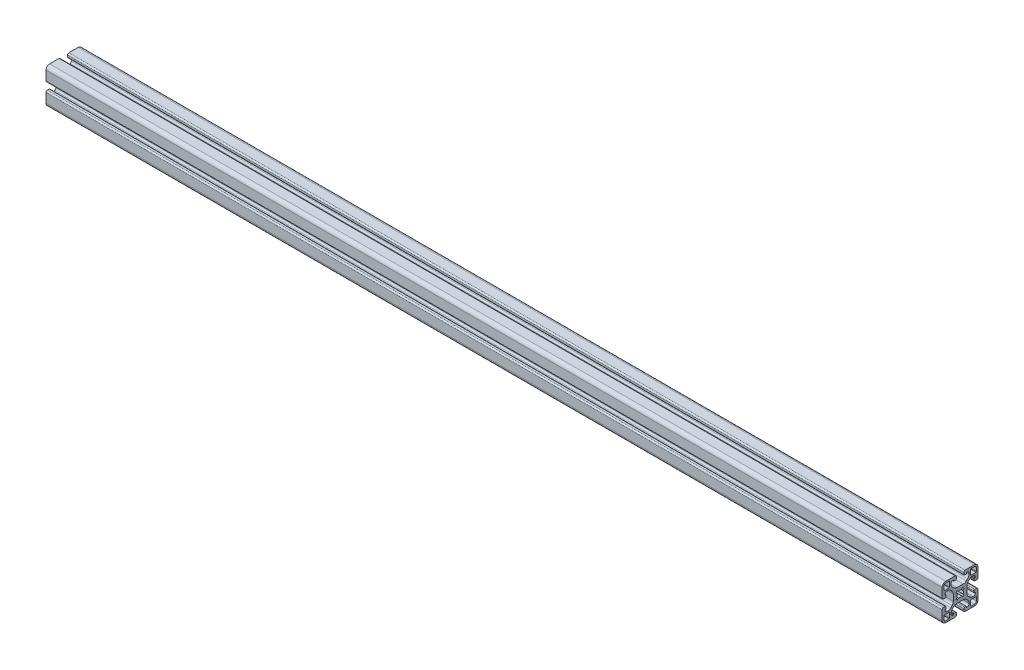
from build123d import *

# Parameters (mm, degrees)
F_40_SARJA_1_0112_40X40_6M_2_DEPTH = 1000


with BuildPart() as part:
    # Model4 → 40-sarja 1.0112 40X40 6M_2 (new body)
    with BuildSketch(Plane(origin=(0, 0, 0), x_dir=(0, 0, -1), z_dir=(1, 0, 0))):
        with BuildLine():
            Line((-10.316133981, -8.376879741), (-8.949467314, -6.916666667))
            ThreePointArc((-8.949467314, -6.916666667), (-7.949588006, -5.336754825), (-7.6, -3.5))
            Line((-7.6, -3.5), (-7.6, 3.5))
            ThreePointArc((-7.6, 3.5), (-7.949588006, 5.336754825), (-8.949467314, 6.916666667))
            Line((-8.949467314, 6.916666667), (-10.316133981, 8.376879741))
            ThreePointArc((-10.316133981, 8.376879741), (-12.018848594, 9.576744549), (-14.058399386, 10))
            Line((-14.058399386, 10), (-14.8, 10))
            ThreePointArc((-14.8, 10), (-16.355634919, 9.355634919), (-17, 7.8))
            Line((-17, 7.8), (-17, 7.6))
            ThreePointArc((-17, 7.6), (-16.853553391, 7.246446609), (-16.5, 7.1))
            Line((-16.5, 7.1), (-16, 7.1))
            ThreePointArc((-16, 7.1), (-15.646446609, 6.953553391), (-15.5, 6.6))
            Line((-15.5, 6.6), (-15.5, 5.1))
            ThreePointArc((-15.5, 5.1), (-15.792893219, 4.392893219), (-16.5, 4.1))
            Line((-16.5, 4.1), (-18.5, 4.1))
            ThreePointArc((-18.5, 4.1), (-19.560660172, 4.539339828), (-20, 5.6))
            Line((-20, 5.6), (-20, 16))
            ThreePointArc((-20, 16), (-18.828427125, 18.828427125), (-16, 20))
            Line((-16, 20), (-5.6, 20))
            ThreePointArc((-5.6, 20), (-4.539339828, 19.560660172), (-4.1, 18.5))
            Line((-4.1, 18.5), (-4.1, 16.5))
            ThreePointArc((-4.1, 16.5), (-4.392893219, 15.792893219), (-5.1, 15.5))
            Line((-5.1, 15.5), (-6.6, 15.5))
            ThreePointArc((-6.6, 15.5), (-6.953553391, 15.646446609), (-7.1, 16))
            Line((-7.1, 16), (-7.1, 16.5))
            ThreePointArc((-7.1, 16.5), (-7.246446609, 16.853553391), (-7.6, 17))
            Line((-7.6, 17), (-7.8, 17))
            ThreePointArc((-7.8, 17), (-9.355634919, 16.355634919), (-10, 14.8))
            Line((-10, 14.8), (-10, 14.053267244))
            ThreePointArc((-10, 14.053267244), (-9.576049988, 12.013150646), (-8.374399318, 10.310844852))
            Line((-8.374399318, 10.310844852), (-6.912704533, 8.945763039))
            ThreePointArc((-6.912704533, 8.945763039), (-5.334232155, 7.948592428), (-3.5, 7.6))
            Line((-3.5, 7.6), (3.5, 7.6))
            ThreePointArc((3.5, 7.6), (5.334232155, 7.948592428), (6.912704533, 8.945763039))
            Line((6.912704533, 8.945763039), (8.374399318, 10.310844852))
            ThreePointArc((8.374399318, 10.310844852), (9.576049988, 12.013150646), (10, 14.053267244))
            Line((10, 14.053267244), (10, 14.8))
            ThreePointArc((10, 14.8), (9.355634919, 16.355634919), (7.8, 17))
            Line((7.8, 17), (7.6, 17))
            ThreePointArc((7.6, 17), (7.246446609, 16.853553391), (7.1, 16.5))
            Line((7.1, 16.5), (7.1, 16))
            ThreePointArc((7.1, 16), (6.953553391, 15.646446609), (6.6, 15.5))
            Line((6.6, 15.5), (5.1, 15.5))
            ThreePointArc((5.1, 15.5), (4.392893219, 15.792893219), (4.1, 16.5))
            Line((4.1, 16.5), (4.1, 18.5))
            ThreePointArc((4.1, 18.5), (4.539339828, 19.560660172), (5.6, 20))
            Line((5.6, 20), (16, 20))
            ThreePointArc((16, 20), (18.828427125, 18.828427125), (20, 16))
            Line((20, 16), (20, 5.6))
            ThreePointArc((20, 5.6), (19.560660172, 4.539339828), (18.5, 4.1))
            Line((18.5, 4.1), (16.5, 4.1))
            ThreePointArc((16.5, 4.1), (15.792893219, 4.392893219), (15.5, 5.1))
            Line((15.5, 5.1), (15.5, 6.6))
            ThreePointArc((15.5, 6.6), (15.646446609, 6.953553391), (16, 7.1))
            Line((16, 7.1), (16.5, 7.1))
            ThreePointArc((16.5, 7.1), (16.853553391, 7.246446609), (17, 7.6))
            Line((17, 7.6), (17, 7.8))
            ThreePointArc((17, 7.8), (16.355634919, 9.355634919), (14.8, 10))
            Line((14.8, 10), (14.058399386, 10))
            ThreePointArc((14.058399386, 10), (12.018848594, 9.576744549), (10.316133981, 8.376879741))
            Line((10.316133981, 8.376879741), (8.949467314, 6.916666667))
            ThreePointArc((8.949467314, 6.916666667), (7.949588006, 5.336754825), (7.6, 3.5))
            Line((7.6, 3.5), (7.6, -3.5))
            ThreePointArc((7.6, -3.5), (7.949588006, -5.336754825), (8.949467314, -6.916666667))
            Line((8.949467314, -6.916666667), (10.316133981, -8.376879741))
            ThreePointArc((10.316133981, -8.376879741), (12.018848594, -9.576744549), (14.058399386, -10))
            Line((14.058399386, -10), (14.8, -10))
            ThreePointArc((14.8, -10), (16.355634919, -9.355634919), (17, -7.8))
            Line((17, -7.8), (17, -7.6))
            ThreePointArc((17, -7.6), (16.853553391, -7.246446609), (16.5, -7.1))
            Line((16.5, -7.1), (16, -7.1))
            ThreePointArc((16, -7.1), (15.646446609, -6.953553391), (15.5, -6.6))
            Line((15.5, -6.6), (15.5, -5.1))
            ThreePointArc((15.5, -5.1), (15.792893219, -4.392893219), (16.5, -4.1))
            Line((16.5, -4.1), (18.5, -4.1))
            ThreePointArc((18.5, -4.1), (19.560660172, -4.539339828), (20, -5.6))
            Line((20, -5.6), (20, -16))
            ThreePointArc((20, -16), (18.828427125, -18.828427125), (16, -20))
            Line((16, -20), (5.6, -20))
            ThreePointArc((5.6, -20), (4.539339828, -19.560660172), (4.1, -18.5))
            Line((4.1, -18.5), (4.1, -16.5))
            ThreePointArc((4.1, -16.5), (4.392893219, -15.792893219), (5.1, -15.5))
            Line((5.1, -15.5), (6.6, -15.5))
            ThreePointArc((6.6, -15.5), (6.953553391, -15.646446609), (7.1, -16))
            Line((7.1, -16), (7.1, -16.5))
            ThreePointArc((7.1, -16.5), (7.246446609, -16.853553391), (7.6, -17))
            Line((7.6, -17), (7.8, -17))
            ThreePointArc((7.8, -17), (9.355634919, -16.355634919), (10, -14.8))
            Line((10, -14.8), (10, -14.053267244))
            ThreePointArc((10, -14.053267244), (9.576049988, -12.013150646), (8.374399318, -10.310844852))
            Line((8.374399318, -10.310844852), (6.912704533, -8.945763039))
            ThreePointArc((6.912704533, -8.945763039), (5.334232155, -7.948592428), (3.5, -7.6))
            Line((3.5, -7.6), (-3.5, -7.6))
            ThreePointArc((-3.5, -7.6), (-5.334232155, -7.948592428), (-6.912704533, -8.945763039))
            Line((-6.912704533, -8.945763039), (-8.374399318, -10.310844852))
            ThreePointArc((-8.374399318, -10.310844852), (-9.576049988, -12.013150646), (-10, -14.053267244))
            Line((-10, -14.053267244), (-10, -14.8))
            ThreePointArc((-10, -14.8), (-9.355634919, -16.355634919), (-7.8, -17))
            Line((-7.8, -17), (-7.6, -17))
            ThreePointArc((-7.6, -17), (-7.246446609, -16.853553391), (-7.1, -16.5))
            Line((-7.1, -16.5), (-7.1, -16))
            ThreePointArc((-7.1, -16), (-6.953553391, -15.646446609), (-6.6, -15.5))
            Line((-6.6, -15.5), (-5.1, -15.5))
            ThreePointArc((-5.1, -15.5), (-4.392893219, -15.792893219), (-4.1, -16.5))
            Line((-4.1, -16.5), (-4.1, -18.5))
            ThreePointArc((-4.1, -18.5), (-4.539339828, -19.560660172), (-5.6, -20))
            Line((-5.6, -20), (-16, -20))
            ThreePointArc((-16, -20), (-18.828427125, -18.828427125), (-20, -16))
            Line((-20, -16), (-20, -5.6))
            ThreePointArc((-20, -5.6), (-19.560660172, -4.539339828), (-18.5, -4.1))
            Line((-18.5, -4.1), (-16.5, -4.1))
            ThreePointArc((-16.5, -4.1), (-15.792893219, -4.392893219), (-15.5, -5.1))
            Line((-15.5, -5.1), (-15.5, -6.6))
            ThreePointArc((-15.5, -6.6), (-15.646446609, -6.953553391), (-16, -7.1))
            Line((-16, -7.1), (-16.5, -7.1))
            ThreePointArc((-16.5, -7.1), (-16.853553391, -7.246446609), (-17, -7.6))
            Line((-17, -7.6), (-17, -7.8))
            ThreePointArc((-17, -7.8), (-16.355634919, -9.355634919), (-14.8, -10))
            Line((-14.8, -10), (-14.058399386, -10))
            ThreePointArc((-14.058399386, -10), (-12.018848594, -9.576744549), (-10.316133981, -8.376879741))
        make_face()
        with BuildLine():
            Line((11.8, -17.7), (11.8, -12.3))
            ThreePointArc((11.8, -12.3), (11.946446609, -11.946446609), (12.3, -11.8))
            Line((12.3, -11.8), (17.7, -11.8))
            ThreePointArc((17.7, -11.8), (18.053553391, -11.946446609), (18.2, -12.3))
            Line((18.2, -12.3), (18.2, -16))
            ThreePointArc((18.2, -16), (17.555634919, -17.555634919), (16, -18.2))
            Line((16, -18.2), (12.3, -18.2))
            ThreePointArc((12.3, -18.2), (11.946446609, -18.053553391), (11.8, -17.7))
        make_face(mode=Mode.SUBTRACT)
        with BuildLine():
            Line((-18.2, -16), (-18.2, -12.3))
            ThreePointArc((-18.2, -12.3), (-18.053553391, -11.946446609), (-17.7, -11.8))
            Line((-17.7, -11.8), (-12.3, -11.8))
            ThreePointArc((-12.3, -11.8), (-11.946446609, -11.946446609), (-11.8, -12.3))
            Line((-11.8, -12.3), (-11.8, -17.7))
            ThreePointArc((-11.8, -17.7), (-11.946446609, -18.053553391), (-12.3, -18.2))
            Line((-12.3, -18.2), (-16, -18.2))
            ThreePointArc((-16, -18.2), (-17.555634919, -17.555634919), (-18.2, -16))
        make_face(mode=Mode.SUBTRACT)
        with BuildLine():
            Line((17.7, 11.8), (12.3, 11.8))
            ThreePointArc((12.3, 11.8), (11.946446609, 11.946446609), (11.8, 12.3))
            Line((11.8, 12.3), (11.8, 17.7))
            ThreePointArc((11.8, 17.7), (11.946446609, 18.053553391), (12.3, 18.2))
            Line((12.3, 18.2), (16, 18.2))
            ThreePointArc((16, 18.2), (17.555634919, 17.555634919), (18.2, 16))
            Line((18.2, 16), (18.2, 12.3))
            ThreePointArc((18.2, 12.3), (18.053553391, 11.946446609), (17.7, 11.8))
        make_face(mode=Mode.SUBTRACT)
        with BuildLine():
            Line((1.793455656, 3.207669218), (2.828668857, 4.24288242))
            Line((2.828668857, 4.24288242), (2.970090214, 4.384303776))
            ThreePointArc((2.970090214, 4.384303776), (3.182222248, 4.472171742), (3.394354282, 4.384303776))
            Line((3.394354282, 4.384303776), (4.24288242, 3.535775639))
            Line((4.24288242, 3.535775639), (4.384303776, 3.394354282))
            ThreePointArc((4.384303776, 3.394354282), (4.472171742, 3.182222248), (4.384303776, 2.970090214))
            Line((4.384303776, 2.970090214), (3.207669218, 1.793455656))
            ThreePointArc((3.207669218, 1.793455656), (3.675, 0), (3.207669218, -1.793455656))
            Line((3.207669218, -1.793455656), (4.24288242, -2.828668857))
            Line((4.24288242, -2.828668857), (4.384303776, -2.970090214))
            ThreePointArc((4.384303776, -2.970090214), (4.472171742, -3.182222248), (4.384303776, -3.394354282))
            Line((4.384303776, -3.394354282), (3.394354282, -4.384303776))
            ThreePointArc((3.394354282, -4.384303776), (3.182222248, -4.472171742), (2.970090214, -4.384303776))
            Line((2.970090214, -4.384303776), (2.828668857, -4.24288242))
            Line((2.828668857, -4.24288242), (1.793455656, -3.207669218))
            ThreePointArc((1.793455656, -3.207669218), (0, -3.675), (-1.793455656, -3.207669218))
            Line((-1.793455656, -3.207669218), (-2.828668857, -4.24288242))
            Line((-2.828668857, -4.24288242), (-2.970090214, -4.384303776))
            ThreePointArc((-2.970090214, -4.384303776), (-3.182222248, -4.472171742), (-3.394354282, -4.384303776))
            Line((-3.394354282, -4.384303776), (-4.24288242, -3.535775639))
            Line((-4.24288242, -3.535775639), (-4.384303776, -3.394354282))
            ThreePointArc((-4.384303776, -3.394354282), (-4.472171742, -3.182222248), (-4.384303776, -2.970090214))
            Line((-4.384303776, -2.970090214), (-3.207669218, -1.793455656))
            ThreePointArc((-3.207669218, -1.793455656), (-3.675, 0), (-3.207669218, 1.793455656))
            Line((-3.207669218, 1.793455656), (-4.24288242, 2.828668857))
            Line((-4.24288242, 2.828668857), (-4.384303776, 2.970090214))
            ThreePointArc((-4.384303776, 2.970090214), (-4.472171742, 3.182222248), (-4.384303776, 3.394354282))
            Line((-4.384303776, 3.394354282), (-3.394354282, 4.384303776))
            ThreePointArc((-3.394354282, 4.384303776), (-3.182222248, 4.472171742), (-2.970090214, 4.384303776))
            Line((-2.970090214, 4.384303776), (-2.828668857, 4.24288242))
            Line((-2.828668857, 4.24288242), (-1.793455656, 3.207669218))
            ThreePointArc((-1.793455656, 3.207669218), (0, 3.675), (1.793455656, 3.207669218))
        make_face(mode=Mode.SUBTRACT)
        with BuildLine():
            Line((-11.8, 17.7), (-11.8, 12.3))
            ThreePointArc((-11.8, 12.3), (-11.946446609, 11.946446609), (-12.3, 11.8))
            Line((-12.3, 11.8), (-17.7, 11.8))
            ThreePointArc((-17.7, 11.8), (-18.053553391, 11.946446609), (-18.2, 12.3))
            Line((-18.2, 12.3), (-18.2, 16))
            ThreePointArc((-18.2, 16), (-17.555634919, 17.555634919), (-16, 18.2))
            Line((-16, 18.2), (-12.3, 18.2))
            ThreePointArc((-12.3, 18.2), (-11.946446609, 18.053553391), (-11.8, 17.7))
        make_face(mode=Mode.SUBTRACT)
    extrude(amount=F_40_SARJA_1_0112_40X40_6M_2_DEPTH)


solid = part.part
